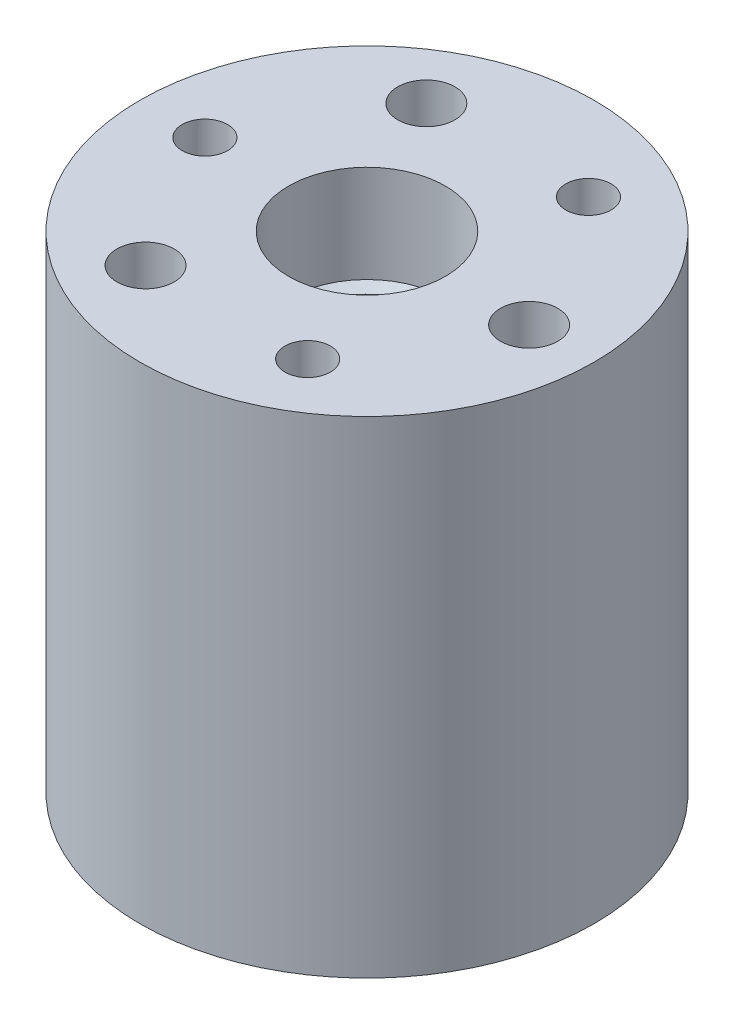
ISO-10303-21;
HEADER;
FILE_DESCRIPTION(('STEP AP214'),'2;1');
FILE_NAME('part.step','',(''),(''),'','','');
FILE_SCHEMA(('AUTOMOTIVE_DESIGN { 1 0 10303 214 1 1 1 1 }'));
ENDSEC;
DATA;
#1=APPLICATION_CONTEXT('core data for automotive mechanical design processes');
#2=APPLICATION_PROTOCOL_DEFINITION('international standard','automotive_design',2000,#1);
#3=PRODUCT_CONTEXT('',#1,'mechanical');
#4=PRODUCT('Part','Part','',(#3));
#5=PRODUCT_RELATED_PRODUCT_CATEGORY('part','',(#4));
#6=PRODUCT_DEFINITION_FORMATION('','',#4);
#7=PRODUCT_DEFINITION_CONTEXT('part definition',#1,'design');
#8=PRODUCT_DEFINITION('design','',#6,#7);
#9=PRODUCT_DEFINITION_SHAPE('','',#8);
#10=(LENGTH_UNIT() NAMED_UNIT(*) SI_UNIT(.MILLI.,.METRE.));
#11=(NAMED_UNIT(*) PLANE_ANGLE_UNIT() SI_UNIT($,.RADIAN.));
#12=(NAMED_UNIT(*) SI_UNIT($,.STERADIAN.) SOLID_ANGLE_UNIT());
#13=UNCERTAINTY_MEASURE_WITH_UNIT(LENGTH_MEASURE(1.E-05),#10,'distance_accuracy_value','');
#14=(GEOMETRIC_REPRESENTATION_CONTEXT(3) GLOBAL_UNCERTAINTY_ASSIGNED_CONTEXT((#13)) GLOBAL_UNIT_ASSIGNED_CONTEXT((#10,
#11,#12)) REPRESENTATION_CONTEXT('',''));
#15=CARTESIAN_POINT('',(0.,0.,0.));
#16=DIRECTION('',(0.,0.,1.));
#17=DIRECTION('',(1.,0.,0.));
#18=AXIS2_PLACEMENT_3D('',#15,#16,#17);
#19=CARTESIAN_POINT('',(0.,-43.,0.));
#20=DIRECTION('',(0.,-1.,0.));
#21=DIRECTION('',(0.,0.,-1.));
#22=AXIS2_PLACEMENT_3D('',#19,#20,#21);
#23=PLANE('',#22);
#24=CARTESIAN_POINT('',(0.,-43.,0.));
#25=DIRECTION('',(0.,1.,0.));
#26=DIRECTION('',(0.,0.,1.));
#27=AXIS2_PLACEMENT_3D('',#24,#25,#26);
#28=CIRCLE('',#27,4.2672);
#29=CARTESIAN_POINT('',(0.,-43.,4.2672));
#30=VERTEX_POINT('',#29);
#31=EDGE_CURVE('E195',#30,#30,#28,.T.);
#32=ORIENTED_EDGE('',*,*,#31,.F.);
#33=EDGE_LOOP('',(#32));
#34=FACE_BOUND('',#33,.T.);
#35=CARTESIAN_POINT('',(0.,-43.,0.));
#36=DIRECTION('',(0.,-1.,0.));
#37=DIRECTION('',(0.,0.,-1.));
#38=AXIS2_PLACEMENT_3D('',#35,#36,#37);
#39=CIRCLE('',#38,1.58749999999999);
#40=CARTESIAN_POINT('',(0.,-43.,-1.58749999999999));
#41=VERTEX_POINT('',#40);
#42=EDGE_CURVE('E82',#41,#41,#39,.F.);
#43=ORIENTED_EDGE('',*,*,#42,.T.);
#44=EDGE_LOOP('',(#43));
#45=FACE_BOUND('',#44,.T.);
#46=ADVANCED_FACE('F42',(#34,#45),#23,.T.);
#47=CARTESIAN_POINT('',(0.,0.,0.));
#48=DIRECTION('',(0.,1.,0.));
#49=DIRECTION('',(0.,0.,1.));
#50=AXIS2_PLACEMENT_3D('',#47,#48,#49);
#51=CYLINDRICAL_SURFACE('',#50,1.58749999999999);
#52=CARTESIAN_POINT('',(-1.37481532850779,-38.5,0.793749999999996));
#53=CARTESIAN_POINT('',(-1.37481893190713,-38.458639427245,0.793747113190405));
#54=CARTESIAN_POINT('',(-1.37671017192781,-38.417226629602,0.790495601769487));
#55=CARTESIAN_POINT('',(-1.38400128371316,-38.3356721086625,0.777655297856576));
#56=CARTESIAN_POINT('',(-1.38940852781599,-38.2955332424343,0.768053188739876));
#57=CARTESIAN_POINT('',(-1.40294793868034,-38.217860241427,0.743029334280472));
#58=CARTESIAN_POINT('',(-1.41106559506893,-38.1803134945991,0.727638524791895));
#59=CARTESIAN_POINT('',(-1.4290886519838,-38.1083445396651,0.691568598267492));
#60=CARTESIAN_POINT('',(-1.43899414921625,-38.0739225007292,0.670889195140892));
#61=CARTESIAN_POINT('',(-1.46047514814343,-38.0060448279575,0.622829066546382));
#62=CARTESIAN_POINT('',(-1.47212100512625,-37.9729030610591,0.595036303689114));
#63=CARTESIAN_POINT('',(-1.49520261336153,-37.9115070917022,0.53439520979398));
#64=CARTESIAN_POINT('',(-1.50663825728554,-37.8832553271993,0.501544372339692));
#65=CARTESIAN_POINT('',(-1.52893297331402,-37.8305773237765,0.429013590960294));
#66=CARTESIAN_POINT('',(-1.53970121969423,-37.8065373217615,0.389022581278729));
#67=CARTESIAN_POINT('',(-1.55853412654,-37.7656694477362,0.304924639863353));
#68=CARTESIAN_POINT('',(-1.56660049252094,-37.7488370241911,0.260820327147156));
#69=CARTESIAN_POINT('',(-1.57861366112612,-37.7241056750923,0.17307317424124));
#70=CARTESIAN_POINT('',(-1.58281274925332,-37.7156563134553,0.129620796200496));
#71=CARTESIAN_POINT('',(-1.58756019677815,-37.7061181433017,0.0417279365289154));
#72=CARTESIAN_POINT('',(-1.58811076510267,-37.7050248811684,-0.002711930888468));
#73=CARTESIAN_POINT('',(-1.58561866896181,-37.710017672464,-0.0871795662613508));
#74=CARTESIAN_POINT('',(-1.58288431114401,-37.71548767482,-0.127254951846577));
#75=CARTESIAN_POINT('',(-1.57459557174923,-37.7323491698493,-0.205830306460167));
#76=CARTESIAN_POINT('',(-1.56904097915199,-37.7437411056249,-0.244330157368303));
#77=CARTESIAN_POINT('',(-1.55552444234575,-37.7721967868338,-0.319333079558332));
#78=CARTESIAN_POINT('',(-1.54753025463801,-37.7893368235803,-0.355801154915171));
#79=CARTESIAN_POINT('',(-1.52985506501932,-37.8286965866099,-0.425431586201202));
#80=CARTESIAN_POINT('',(-1.52017345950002,-37.8509181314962,-0.458592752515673));
#81=CARTESIAN_POINT('',(-1.49895238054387,-37.9022231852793,-0.524012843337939));
#82=CARTESIAN_POINT('',(-1.4873237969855,-37.9317567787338,-0.55589017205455));
#83=CARTESIAN_POINT('',(-1.46410632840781,-37.9956430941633,-0.614445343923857));
#84=CARTESIAN_POINT('',(-1.45251748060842,-38.0299994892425,-0.64111918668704));
#85=CARTESIAN_POINT('',(-1.42989423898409,-38.1052270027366,-0.690169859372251));
#86=CARTESIAN_POINT('',(-1.41894178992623,-38.1463732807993,-0.712166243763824));
#87=CARTESIAN_POINT('',(-1.39998013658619,-38.2324567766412,-0.748759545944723));
#88=CARTESIAN_POINT('',(-1.39196786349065,-38.2773899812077,-0.76336418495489));
#89=CARTESIAN_POINT('',(-1.3806855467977,-38.3660265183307,-0.783574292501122));
#90=CARTESIAN_POINT('',(-1.37709001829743,-38.4095451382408,-0.789801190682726));
#91=CARTESIAN_POINT('',(-1.37412348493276,-38.4971435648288,-0.794954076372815));
#92=CARTESIAN_POINT('',(-1.3747494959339,-38.5412229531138,-0.793885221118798));
#93=CARTESIAN_POINT('',(-1.37981004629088,-38.6235502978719,-0.785047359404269));
#94=CARTESIAN_POINT('',(-1.38382047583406,-38.6619086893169,-0.778024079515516));
#95=CARTESIAN_POINT('',(-1.39457129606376,-38.7368294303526,-0.758583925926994));
#96=CARTESIAN_POINT('',(-1.40131257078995,-38.7733911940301,-0.746165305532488));
#97=CARTESIAN_POINT('',(-1.41713126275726,-38.845607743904,-0.715682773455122));
#98=CARTESIAN_POINT('',(-1.4263024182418,-38.8811420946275,-0.697384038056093));
#99=CARTESIAN_POINT('',(-1.44586419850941,-38.9488412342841,-0.65586535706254));
#100=CARTESIAN_POINT('',(-1.45625544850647,-38.9810042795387,-0.632642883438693));
#101=CARTESIAN_POINT('',(-1.47866098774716,-39.0452893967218,-0.578514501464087));
#102=CARTESIAN_POINT('',(-1.49071475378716,-39.0768952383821,-0.547009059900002));
#103=CARTESIAN_POINT('',(-1.51395299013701,-39.1345334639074,-0.47895231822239));
#104=CARTESIAN_POINT('',(-1.52513716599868,-39.1605639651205,-0.44239932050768));
#105=CARTESIAN_POINT('',(-1.54575955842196,-39.2068928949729,-0.363962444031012));
#106=CARTESIAN_POINT('',(-1.55514390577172,-39.2270219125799,-0.32196333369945));
#107=CARTESIAN_POINT('',(-1.57069912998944,-39.2597282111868,-0.234570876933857));
#108=CARTESIAN_POINT('',(-1.5768728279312,-39.272312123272,-0.189180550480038));
#109=CARTESIAN_POINT('',(-1.58486084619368,-39.2884862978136,-0.100790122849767));
#110=CARTESIAN_POINT('',(-1.58702317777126,-39.2927958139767,-0.0579528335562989));
#111=CARTESIAN_POINT('',(-1.58783440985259,-39.2944193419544,0.02788125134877));
#112=CARTESIAN_POINT('',(-1.58648454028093,-39.2917358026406,0.0708779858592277));
#113=CARTESIAN_POINT('',(-1.580625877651,-39.279925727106,0.152827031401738));
#114=CARTESIAN_POINT('',(-1.57633110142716,-39.2712354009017,0.191859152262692));
#115=CARTESIAN_POINT('',(-1.56521224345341,-39.2482466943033,0.267847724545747));
#116=CARTESIAN_POINT('',(-1.55838779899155,-39.2339475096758,0.304803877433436));
#117=CARTESIAN_POINT('',(-1.54246207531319,-39.1995104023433,0.377367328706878));
#118=CARTESIAN_POINT('',(-1.53327589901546,-39.1791489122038,0.412849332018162));
#119=CARTESIAN_POINT('',(-1.51358705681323,-39.1334458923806,0.480039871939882));
#120=CARTESIAN_POINT('',(-1.50308378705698,-39.1081020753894,0.511746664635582));
#121=CARTESIAN_POINT('',(-1.48057084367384,-39.0502297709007,0.573812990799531));
#122=CARTESIAN_POINT('',(-1.46851527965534,-39.017237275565,0.603724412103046));
#123=CARTESIAN_POINT('',(-1.44512566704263,-38.9465234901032,0.657751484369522));
#124=CARTESIAN_POINT('',(-1.4337922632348,-38.9087980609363,0.68186200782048));
#125=CARTESIAN_POINT('',(-1.41287186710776,-38.8281071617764,0.724242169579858));
#126=CARTESIAN_POINT('',(-1.40335138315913,-38.7850137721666,0.742303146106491));
#127=CARTESIAN_POINT('',(-1.38800011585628,-38.6957924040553,0.77063497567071));
#128=CARTESIAN_POINT('',(-1.38215700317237,-38.6496751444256,0.780931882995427));
#129=CARTESIAN_POINT('',(-1.3773886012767,-38.5858794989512,0.789278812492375));
#130=CARTESIAN_POINT('',(-1.37642702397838,-38.5687642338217,0.790952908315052));
#131=CARTESIAN_POINT('',(-1.37513961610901,-38.5344356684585,0.793189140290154));
#132=CARTESIAN_POINT('',(-1.37481382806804,-38.5172223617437,0.793751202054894));
#133=CARTESIAN_POINT('',(-1.37481532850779,-38.5,0.793749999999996));
#134=B_SPLINE_CURVE_WITH_KNOTS('',3,(#52,#53,#54,#55,#56,#57,#58,#59,#60,#61,#62,#63,#64,#65,
#66,#67,#68,#69,#70,#71,#72,#73,#74,#75,#76,#77,#78,#79,#80,#81,#82,#83,#84,#85,#86,#87,#88,#89,
#90,#91,#92,#93,#94,#95,#96,#97,#98,#99,#100,#101,#102,#103,#104,#105,#106,#107,#108,#109,#110,
#111,#112,#113,#114,#115,#116,#117,#118,#119,#120,#121,#122,#123,#124,#125,#126,#127,#128,#129,
#130,#131,#132,#133),.UNSPECIFIED.,.T.,.F.,(4,2,2,2,2,2,2,2,2,2,2,2,2,2,2,2,2,2,2,2,2,2,2,2,2,2,
2,2,2,2,2,2,2,2,2,2,2,2,2,2,4),(0.,0.124009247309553,0.248279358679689,0.371894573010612,
0.495516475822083,0.629334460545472,0.763218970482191,0.906128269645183,1.04894718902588,
1.18160391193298,1.31418031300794,1.43522777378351,1.55628429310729,1.67901568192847,
1.80179106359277,1.93617208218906,2.07065600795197,2.21368018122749,2.35655464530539,
2.48810693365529,2.6195662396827,2.7366450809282,2.85376185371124,2.97630291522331,
3.09890704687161,3.2369660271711,3.37507155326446,3.5168219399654,3.65844756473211,
3.78707864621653,3.91566468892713,4.03577762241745,4.15590778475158,4.28117595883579,
4.40650177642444,4.54430004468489,4.68221967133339,4.8244978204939,4.96629636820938,
5.01792982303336,5.06956673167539),.UNSPECIFIED.);
#135=CARTESIAN_POINT('',(-1.37481532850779,-38.5,0.793749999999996));
#136=VERTEX_POINT('',#135);
#137=EDGE_CURVE('E186',#136,#136,#134,.T.);
#138=ORIENTED_EDGE('',*,*,#137,.T.);
#139=EDGE_LOOP('',(#138));
#140=FACE_BOUND('',#139,.T.);
#141=CARTESIAN_POINT('',(0.,-36.,0.));
#142=DIRECTION('',(0.,1.,0.));
#143=DIRECTION('',(0.,0.,1.));
#144=AXIS2_PLACEMENT_3D('',#141,#142,#143);
#145=CIRCLE('',#144,1.58749999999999);
#146=CARTESIAN_POINT('',(0.,-36.,1.58749999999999));
#147=VERTEX_POINT('',#146);
#148=EDGE_CURVE('E133',#147,#147,#145,.F.);
#149=ORIENTED_EDGE('',*,*,#148,.F.);
#150=EDGE_LOOP('',(#149));
#151=FACE_BOUND('',#150,.T.);
#152=ORIENTED_EDGE('',*,*,#42,.F.);
#153=EDGE_LOOP('',(#152));
#154=FACE_BOUND('',#153,.T.);
#155=ADVANCED_FACE('F199',(#140,#151,#154),#51,.F.);
#156=CARTESIAN_POINT('',(0.,-45.,0.));
#157=DIRECTION('',(0.,1.,0.));
#158=DIRECTION('',(0.,0.,1.));
#159=AXIS2_PLACEMENT_3D('',#156,#157,#158);
#160=CYLINDRICAL_SURFACE('',#159,21.);
#161=CARTESIAN_POINT('',(-20.9026894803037,-38.5,2.0193));
#162=CARTESIAN_POINT('',(-20.9026907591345,-38.3868566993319,2.01929508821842));
#163=CARTESIAN_POINT('',(-20.9036180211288,-38.2736380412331,2.00975869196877));
#164=CARTESIAN_POINT('',(-20.9072264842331,-38.050338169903,1.97185930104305));
#165=CARTESIAN_POINT('',(-20.9099096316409,-37.9402605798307,1.94347541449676));
#166=CARTESIAN_POINT('',(-20.9167231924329,-37.7265089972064,1.86871380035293));
#167=CARTESIAN_POINT('',(-20.9208527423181,-37.6228312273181,1.82234680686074));
#168=CARTESIAN_POINT('',(-20.9300927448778,-37.4247528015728,1.71295542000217));
#169=CARTESIAN_POINT('',(-20.9352029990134,-37.330350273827,1.64993439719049));
#170=CARTESIAN_POINT('',(-20.9458479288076,-37.1531607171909,1.50879527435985));
#171=CARTESIAN_POINT('',(-20.9513838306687,-37.0704093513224,1.43063249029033));
#172=CARTESIAN_POINT('',(-20.9622451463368,-36.9191780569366,1.26152389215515));
#173=CARTESIAN_POINT('',(-20.967570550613,-36.8506987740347,1.17057750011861));
#174=CARTESIAN_POINT('',(-20.9774228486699,-36.7298332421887,0.978266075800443));
#175=CARTESIAN_POINT('',(-20.9819481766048,-36.6774784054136,0.876881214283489));
#176=CARTESIAN_POINT('',(-20.9896771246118,-36.5905488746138,0.666708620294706));
#177=CARTESIAN_POINT('',(-20.992880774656,-36.5559737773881,0.557921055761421));
#178=CARTESIAN_POINT('',(-20.9975968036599,-36.5056893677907,0.336390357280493));
#179=CARTESIAN_POINT('',(-20.9991144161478,-36.4899216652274,0.22366059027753));
#180=CARTESIAN_POINT('',(-21.0003051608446,-36.4775190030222,-0.00285480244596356));
#181=CARTESIAN_POINT('',(-20.9999783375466,-36.4808835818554,-0.116640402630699));
#182=CARTESIAN_POINT('',(-20.9975213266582,-36.5066024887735,-0.341641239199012));
#183=CARTESIAN_POINT('',(-20.9953971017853,-36.5288940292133,-0.452863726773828));
#184=CARTESIAN_POINT('',(-20.989590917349,-36.5917363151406,-0.669981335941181));
#185=CARTESIAN_POINT('',(-20.9859089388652,-36.6322872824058,-0.775876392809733));
#186=CARTESIAN_POINT('',(-20.9773910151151,-36.7305664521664,-0.979531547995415));
#187=CARTESIAN_POINT('',(-20.9725532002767,-36.7883225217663,-1.07727811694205));
#188=CARTESIAN_POINT('',(-20.962266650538,-36.9193521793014,-1.26171399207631));
#189=CARTESIAN_POINT('',(-20.9568178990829,-36.99262618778,-1.34840299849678));
#190=CARTESIAN_POINT('',(-20.945895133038,-37.152965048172,-1.50863056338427));
#191=CARTESIAN_POINT('',(-20.940421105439,-37.2400845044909,-1.58211448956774));
#192=CARTESIAN_POINT('',(-20.9300867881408,-37.4254516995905,-1.71342321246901));
#193=CARTESIAN_POINT('',(-20.9252264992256,-37.523699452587,-1.77124798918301));
#194=CARTESIAN_POINT('',(-20.9166694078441,-37.7285754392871,-1.86959626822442));
#195=CARTESIAN_POINT('',(-20.9129728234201,-37.8352052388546,-1.91011652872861));
#196=CARTESIAN_POINT('',(-20.9071661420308,-38.0537983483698,-1.97266300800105));
#197=CARTESIAN_POINT('',(-20.9050560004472,-38.1657615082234,-1.99468974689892));
#198=CARTESIAN_POINT('',(-20.902668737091,-38.391363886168,-2.01955392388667));
#199=CARTESIAN_POINT('',(-20.9023843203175,-38.5049946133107,-2.0224677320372));
#200=CARTESIAN_POINT('',(-20.9036614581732,-38.7311273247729,-2.00922377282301));
#201=CARTESIAN_POINT('',(-20.9052229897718,-38.843629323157,-1.99306624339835));
#202=CARTESIAN_POINT('',(-20.9100094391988,-39.0640892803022,-1.94220210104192));
#203=CARTESIAN_POINT('',(-20.913231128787,-39.1720556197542,-1.90753148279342));
#204=CARTESIAN_POINT('',(-20.9209722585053,-39.3806397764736,-1.82066204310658));
#205=CARTESIAN_POINT('',(-20.9254917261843,-39.481257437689,-1.76846284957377));
#206=CARTESIAN_POINT('',(-20.9353368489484,-39.672636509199,-1.64782621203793));
#207=CARTESIAN_POINT('',(-20.9406650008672,-39.7633658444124,-1.57933809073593));
#208=CARTESIAN_POINT('',(-20.9515189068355,-39.9320677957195,-1.42814049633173));
#209=CARTESIAN_POINT('',(-20.9570446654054,-40.0100401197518,-1.34543069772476));
#210=CARTESIAN_POINT('',(-20.9676931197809,-40.1512774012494,-1.16780658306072));
#211=CARTESIAN_POINT('',(-20.9728144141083,-40.2144925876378,-1.07285259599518));
#212=CARTESIAN_POINT('',(-20.9820565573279,-40.3240789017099,-0.873631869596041));
#213=CARTESIAN_POINT('',(-20.9861774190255,-40.3704502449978,-0.769365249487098));
#214=CARTESIAN_POINT('',(-20.992948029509,-40.4449479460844,-0.554653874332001));
#215=CARTESIAN_POINT('',(-20.9956002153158,-40.4731045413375,-0.444219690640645));
#216=CARTESIAN_POINT('',(-20.9991446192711,-40.5104722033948,-0.220164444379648));
#217=CARTESIAN_POINT('',(-21.0000368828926,-40.5196837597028,-0.106543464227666));
#218=CARTESIAN_POINT('',(-20.9999609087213,-40.5188932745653,0.120170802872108));
#219=CARTESIAN_POINT('',(-20.9990001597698,-40.5089685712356,0.233264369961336));
#220=CARTESIAN_POINT('',(-20.9953408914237,-40.4703492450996,0.456169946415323));
#221=CARTESIAN_POINT('',(-20.9926423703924,-40.4416546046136,0.565981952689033));
#222=CARTESIAN_POINT('',(-20.9858100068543,-40.3663309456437,0.779208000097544));
#223=CARTESIAN_POINT('',(-20.9816763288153,-40.3197039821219,0.882622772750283));
#224=CARTESIAN_POINT('',(-20.9724348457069,-40.2098476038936,1.08017002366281));
#225=CARTESIAN_POINT('',(-20.9673270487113,-40.1466183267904,1.17430257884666));
#226=CARTESIAN_POINT('',(-20.956685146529,-40.0050619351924,1.35100961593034));
#227=CARTESIAN_POINT('',(-20.9511494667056,-39.9266772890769,1.4335379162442));
#228=CARTESIAN_POINT('',(-20.9402890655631,-39.7571468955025,1.58430530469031));
#229=CARTESIAN_POINT('',(-20.9349643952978,-39.6659980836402,1.65254095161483));
#230=CARTESIAN_POINT('',(-20.9251153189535,-39.4732923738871,1.7729117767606));
#231=CARTESIAN_POINT('',(-20.9205928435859,-39.3717112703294,1.82500833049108));
#232=CARTESIAN_POINT('',(-20.9128833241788,-39.1612656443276,1.91133637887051));
#233=CARTESIAN_POINT('',(-20.9096947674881,-39.0524095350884,1.94558812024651));
#234=CARTESIAN_POINT('',(-20.9058221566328,-38.8691087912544,1.98666784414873));
#235=CARTESIAN_POINT('',(-20.9046529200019,-38.7958378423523,1.99888829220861));
#236=CARTESIAN_POINT('',(-20.9030861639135,-38.6483887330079,2.01520596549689));
#237=CARTESIAN_POINT('',(-20.9026886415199,-38.5742105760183,2.01930322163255));
#238=CARTESIAN_POINT('',(-20.9026894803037,-38.5,2.0193));
#239=B_SPLINE_CURVE_WITH_KNOTS('',3,(#161,#162,#163,#164,#165,#166,#167,#168,#169,#170,#171,
#172,#173,#174,#175,#176,#177,#178,#179,#180,#181,#182,#183,#184,#185,#186,#187,#188,#189,#190,
#191,#192,#193,#194,#195,#196,#197,#198,#199,#200,#201,#202,#203,#204,#205,#206,#207,#208,#209,
#210,#211,#212,#213,#214,#215,#216,#217,#218,#219,#220,#221,#222,#223,#224,#225,#226,#227,#228,
#229,#230,#231,#232,#233,#234,#235,#236,#237,#238),.UNSPECIFIED.,.T.,.F.,(4,2,2,2,2,2,2,2,2,2,2,
2,2,2,2,2,2,2,2,2,2,2,2,2,2,2,2,2,2,2,2,2,2,2,2,2,2,2,4),(0.,0.339158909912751,
0.678694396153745,1.01802752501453,1.35729202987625,1.69757340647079,2.03787017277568,
2.37882574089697,2.71977357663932,3.05966011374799,3.39953845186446,3.73829367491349,
4.07705301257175,4.41636404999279,4.75568428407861,5.09637756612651,5.43707128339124,
5.77782879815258,6.11857672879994,6.45796228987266,6.79734361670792,7.13606748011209,
7.47479853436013,7.81459754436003,8.15440433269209,8.49534113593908,8.83627357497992,
9.17663858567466,9.51699480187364,9.85597837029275,10.1949622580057,10.5339073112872,
10.8728495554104,11.213104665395,11.5534416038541,11.8945868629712,12.2353442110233,
12.4577990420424,12.6802530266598),.UNSPECIFIED.);
#240=CARTESIAN_POINT('',(-20.9026894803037,-38.5,2.0193));
#241=VERTEX_POINT('',#240);
#242=EDGE_CURVE('E138',#241,#241,#239,.T.);
#243=ORIENTED_EDGE('',*,*,#242,.F.);
#244=EDGE_LOOP('',(#243));
#245=FACE_BOUND('',#244,.T.);
#246=CARTESIAN_POINT('',(0.,-45.,0.));
#247=DIRECTION('',(0.,1.,0.));
#248=DIRECTION('',(0.,0.,1.));
#249=AXIS2_PLACEMENT_3D('',#246,#247,#248);
#250=CIRCLE('',#249,21.);
#251=CARTESIAN_POINT('',(0.,-45.,21.));
#252=VERTEX_POINT('',#251);
#253=EDGE_CURVE('E134',#252,#252,#250,.T.);
#254=ORIENTED_EDGE('',*,*,#253,.T.);
#255=EDGE_LOOP('',(#254));
#256=FACE_BOUND('',#255,.T.);
#257=CARTESIAN_POINT('',(0.,0.,0.));
#258=DIRECTION('',(0.,1.,0.));
#259=DIRECTION('',(0.,0.,1.));
#260=AXIS2_PLACEMENT_3D('',#257,#258,#259);
#261=CIRCLE('',#260,21.);
#262=CARTESIAN_POINT('',(0.,0.,21.));
#263=VERTEX_POINT('',#262);
#264=EDGE_CURVE('E139',#263,#263,#261,.T.);
#265=ORIENTED_EDGE('',*,*,#264,.F.);
#266=EDGE_LOOP('',(#265));
#267=FACE_BOUND('',#266,.T.);
#268=ADVANCED_FACE('F162',(#245,#256,#267),#160,.T.);
#269=CARTESIAN_POINT('',(0.,-45.,0.));
#270=DIRECTION('',(0.,1.,0.));
#271=DIRECTION('',(0.,0.,1.));
#272=AXIS2_PLACEMENT_3D('',#269,#270,#271);
#273=PLANE('',#272);
#274=CARTESIAN_POINT('',(0.,-45.,0.));
#275=DIRECTION('',(0.,1.,0.));
#276=DIRECTION('',(0.,0.,1.));
#277=AXIS2_PLACEMENT_3D('',#274,#275,#276);
#278=CIRCLE('',#277,8.50000000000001);
#279=CARTESIAN_POINT('',(0.,-45.,8.50000000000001));
#280=VERTEX_POINT('',#279);
#281=EDGE_CURVE('E11',#280,#280,#278,.T.);
#282=ORIENTED_EDGE('',*,*,#281,.T.);
#283=EDGE_LOOP('',(#282));
#284=FACE_BOUND('',#283,.T.);
#285=CARTESIAN_POINT('',(-7.49999999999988,-45.,-12.9903810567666));
#286=DIRECTION('',(0.,1.,0.));
#287=DIRECTION('',(0.,0.,1.));
#288=AXIS2_PLACEMENT_3D('',#285,#286,#287);
#289=CIRCLE('',#288,2.64999999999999);
#290=CARTESIAN_POINT('',(-7.49999999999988,-45.,-10.3403810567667));
#291=VERTEX_POINT('',#290);
#292=EDGE_CURVE('E101',#291,#291,#289,.T.);
#293=ORIENTED_EDGE('',*,*,#292,.T.);
#294=EDGE_LOOP('',(#293));
#295=FACE_BOUND('',#294,.T.);
#296=CARTESIAN_POINT('',(-7.50000000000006,-45.,12.9903810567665));
#297=DIRECTION('',(0.,1.,0.));
#298=DIRECTION('',(0.,0.,1.));
#299=AXIS2_PLACEMENT_3D('',#296,#297,#298);
#300=CIRCLE('',#299,2.64999999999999);
#301=CARTESIAN_POINT('',(-7.50000000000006,-45.,15.6403810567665));
#302=VERTEX_POINT('',#301);
#303=EDGE_CURVE('E108',#302,#302,#300,.T.);
#304=ORIENTED_EDGE('',*,*,#303,.T.);
#305=EDGE_LOOP('',(#304));
#306=FACE_BOUND('',#305,.T.);
#307=CARTESIAN_POINT('',(15.,-45.,0.));
#308=DIRECTION('',(0.,1.,0.));
#309=DIRECTION('',(0.,0.,1.));
#310=AXIS2_PLACEMENT_3D('',#307,#308,#309);
#311=CIRCLE('',#310,2.64999999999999);
#312=CARTESIAN_POINT('',(15.,-45.,2.64999999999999));
#313=VERTEX_POINT('',#312);
#314=EDGE_CURVE('E116',#313,#313,#311,.T.);
#315=ORIENTED_EDGE('',*,*,#314,.T.);
#316=EDGE_LOOP('',(#315));
#317=FACE_BOUND('',#316,.T.);
#318=ORIENTED_EDGE('',*,*,#253,.F.);
#319=EDGE_LOOP('',(#318));
#320=FACE_BOUND('',#319,.T.);
#321=ADVANCED_FACE('F207',(#284,#295,#306,#317,#320),#273,.F.);
#322=CARTESIAN_POINT('',(0.,0.,0.));
#323=DIRECTION('',(0.,1.,0.));
#324=DIRECTION('',(0.,0.,1.));
#325=AXIS2_PLACEMENT_3D('',#322,#323,#324);
#326=PLANE('',#325);
#327=CARTESIAN_POINT('',(7.49999999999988,0.,12.9903810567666));
#328=DIRECTION('',(0.,1.,0.));
#329=DIRECTION('',(0.,0.,1.));
#330=AXIS2_PLACEMENT_3D('',#327,#328,#329);
#331=CIRCLE('',#330,2.09999999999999);
#332=CARTESIAN_POINT('',(7.49999999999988,0.,15.0903810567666));
#333=VERTEX_POINT('',#332);
#334=EDGE_CURVE('E73',#333,#333,#331,.T.);
#335=ORIENTED_EDGE('',*,*,#334,.F.);
#336=EDGE_LOOP('',(#335));
#337=FACE_BOUND('',#336,.T.);
#338=CARTESIAN_POINT('',(7.50000000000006,0.,-12.9903810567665));
#339=DIRECTION('',(0.,1.,0.));
#340=DIRECTION('',(0.,0.,1.));
#341=AXIS2_PLACEMENT_3D('',#338,#339,#340);
#342=CIRCLE('',#341,2.09999999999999);
#343=CARTESIAN_POINT('',(7.50000000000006,0.,-10.8903810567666));
#344=VERTEX_POINT('',#343);
#345=EDGE_CURVE('E72',#344,#344,#342,.T.);
#346=ORIENTED_EDGE('',*,*,#345,.F.);
#347=EDGE_LOOP('',(#346));
#348=FACE_BOUND('',#347,.T.);
#349=CARTESIAN_POINT('',(-15.,0.,0.));
#350=DIRECTION('',(0.,1.,0.));
#351=DIRECTION('',(0.,0.,1.));
#352=AXIS2_PLACEMENT_3D('',#349,#350,#351);
#353=CIRCLE('',#352,2.09999999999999);
#354=CARTESIAN_POINT('',(-15.,0.,2.09999999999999));
#355=VERTEX_POINT('',#354);
#356=EDGE_CURVE('E89',#355,#355,#353,.T.);
#357=ORIENTED_EDGE('',*,*,#356,.F.);
#358=EDGE_LOOP('',(#357));
#359=FACE_BOUND('',#358,.T.);
#360=CARTESIAN_POINT('',(-7.49999999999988,0.,-12.9903810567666));
#361=DIRECTION('',(0.,1.,0.));
#362=DIRECTION('',(0.,0.,1.));
#363=AXIS2_PLACEMENT_3D('',#360,#361,#362);
#364=CIRCLE('',#363,2.65);
#365=CARTESIAN_POINT('',(-7.49999999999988,0.,-10.3403810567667));
#366=VERTEX_POINT('',#365);
#367=EDGE_CURVE('E97',#366,#366,#364,.T.);
#368=ORIENTED_EDGE('',*,*,#367,.F.);
#369=EDGE_LOOP('',(#368));
#370=FACE_BOUND('',#369,.T.);
#371=CARTESIAN_POINT('',(-7.50000000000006,0.,12.9903810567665));
#372=DIRECTION('',(0.,1.,0.));
#373=DIRECTION('',(0.,0.,1.));
#374=AXIS2_PLACEMENT_3D('',#371,#372,#373);
#375=CIRCLE('',#374,2.65);
#376=CARTESIAN_POINT('',(-7.50000000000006,0.,15.6403810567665));
#377=VERTEX_POINT('',#376);
#378=EDGE_CURVE('E104',#377,#377,#375,.T.);
#379=ORIENTED_EDGE('',*,*,#378,.F.);
#380=EDGE_LOOP('',(#379));
#381=FACE_BOUND('',#380,.T.);
#382=CARTESIAN_POINT('',(15.,0.,0.));
#383=DIRECTION('',(0.,1.,0.));
#384=DIRECTION('',(0.,0.,1.));
#385=AXIS2_PLACEMENT_3D('',#382,#383,#384);
#386=CIRCLE('',#385,2.65);
#387=CARTESIAN_POINT('',(15.,0.,2.65));
#388=VERTEX_POINT('',#387);
#389=EDGE_CURVE('E112',#388,#388,#386,.T.);
#390=ORIENTED_EDGE('',*,*,#389,.F.);
#391=EDGE_LOOP('',(#390));
#392=FACE_BOUND('',#391,.T.);
#393=CARTESIAN_POINT('',(0.,0.,0.));
#394=DIRECTION('',(0.,1.,0.));
#395=DIRECTION('',(0.,0.,1.));
#396=AXIS2_PLACEMENT_3D('',#393,#394,#395);
#397=CIRCLE('',#396,7.24999999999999);
#398=CARTESIAN_POINT('',(0.,0.,7.24999999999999));
#399=VERTEX_POINT('',#398);
#400=EDGE_CURVE('E120',#399,#399,#397,.T.);
#401=ORIENTED_EDGE('',*,*,#400,.F.);
#402=EDGE_LOOP('',(#401));
#403=FACE_BOUND('',#402,.T.);
#404=ORIENTED_EDGE('',*,*,#264,.T.);
#405=EDGE_LOOP('',(#404));
#406=FACE_BOUND('',#405,.T.);
#407=ADVANCED_FACE('F209',(#337,#348,#359,#370,#381,#392,#403,#406),#326,.T.);
#408=CARTESIAN_POINT('',(0.,-36.,0.));
#409=DIRECTION('',(0.,1.,0.));
#410=DIRECTION('',(0.,0.,1.));
#411=AXIS2_PLACEMENT_3D('',#408,#409,#410);
#412=PLANE('',#411);
#413=CARTESIAN_POINT('',(0.,-36.,0.));
#414=DIRECTION('',(0.,1.,0.));
#415=DIRECTION('',(0.,0.,1.));
#416=AXIS2_PLACEMENT_3D('',#413,#414,#415);
#417=CIRCLE('',#416,6.35);
#418=CARTESIAN_POINT('',(0.,-36.,6.35));
#419=VERTEX_POINT('',#418);
#420=EDGE_CURVE('E129',#419,#419,#417,.T.);
#421=ORIENTED_EDGE('',*,*,#420,.T.);
#422=EDGE_LOOP('',(#421));
#423=FACE_BOUND('',#422,.T.);
#424=ORIENTED_EDGE('',*,*,#148,.T.);
#425=EDGE_LOOP('',(#424));
#426=FACE_BOUND('',#425,.T.);
#427=ADVANCED_FACE('F212',(#423,#426),#412,.T.);
#428=CARTESIAN_POINT('',(0.,-36.,0.));
#429=DIRECTION('',(0.,1.,0.));
#430=DIRECTION('',(0.,0.,1.));
#431=AXIS2_PLACEMENT_3D('',#428,#429,#430);
#432=CYLINDRICAL_SURFACE('',#431,6.35);
#433=CARTESIAN_POINT('',(0.,-9.5407745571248,0.));
#434=DIRECTION('',(0.,1.,0.));
#435=DIRECTION('',(0.,0.,1.));
#436=AXIS2_PLACEMENT_3D('',#433,#434,#435);
#437=CIRCLE('',#436,6.35);
#438=CARTESIAN_POINT('',(0.,-9.5407745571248,6.35));
#439=VERTEX_POINT('',#438);
#440=EDGE_CURVE('E128',#439,#439,#437,.T.);
#441=ORIENTED_EDGE('',*,*,#440,.T.);
#442=EDGE_LOOP('',(#441));
#443=FACE_BOUND('',#442,.T.);
#444=ORIENTED_EDGE('',*,*,#420,.F.);
#445=EDGE_LOOP('',(#444));
#446=FACE_BOUND('',#445,.T.);
#447=ADVANCED_FACE('F205',(#443,#446),#432,.F.);
#448=CARTESIAN_POINT('',(0.,-9.,0.));
#449=DIRECTION('',(0.,1.,0.));
#450=DIRECTION('',(0.,0.,1.));
#451=AXIS2_PLACEMENT_3D('',#448,#449,#450);
#452=CONICAL_SURFACE('',#451,7.25,1.02974425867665);
#453=CARTESIAN_POINT('',(0.,-9.,0.));
#454=DIRECTION('',(0.,1.,0.));
#455=DIRECTION('',(0.,0.,1.));
#456=AXIS2_PLACEMENT_3D('',#453,#454,#455);
#457=CIRCLE('',#456,7.25);
#458=CARTESIAN_POINT('',(0.,-9.,7.25));
#459=VERTEX_POINT('',#458);
#460=EDGE_CURVE('E124',#459,#459,#457,.T.);
#461=ORIENTED_EDGE('',*,*,#460,.T.);
#462=EDGE_LOOP('',(#461));
#463=FACE_BOUND('',#462,.T.);
#464=ORIENTED_EDGE('',*,*,#440,.F.);
#465=EDGE_LOOP('',(#464));
#466=FACE_BOUND('',#465,.T.);
#467=ADVANCED_FACE('F493',(#463,#466),#452,.F.);
#468=CARTESIAN_POINT('',(0.,0.,0.));
#469=DIRECTION('',(0.,1.,0.));
#470=DIRECTION('',(0.,0.,1.));
#471=AXIS2_PLACEMENT_3D('',#468,#469,#470);
#472=CYLINDRICAL_SURFACE('',#471,7.24999999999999);
#473=ORIENTED_EDGE('',*,*,#460,.F.);
#474=EDGE_LOOP('',(#473));
#475=FACE_BOUND('',#474,.T.);
#476=ORIENTED_EDGE('',*,*,#400,.T.);
#477=EDGE_LOOP('',(#476));
#478=FACE_BOUND('',#477,.T.);
#479=ADVANCED_FACE('F483',(#475,#478),#472,.F.);
#480=CARTESIAN_POINT('',(15.,0.,0.));
#481=DIRECTION('',(0.,1.,0.));
#482=DIRECTION('',(0.,0.,1.));
#483=AXIS2_PLACEMENT_3D('',#480,#481,#482);
#484=CYLINDRICAL_SURFACE('',#483,2.64999999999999);
#485=ORIENTED_EDGE('',*,*,#314,.F.);
#486=EDGE_LOOP('',(#485));
#487=FACE_BOUND('',#486,.T.);
#488=ORIENTED_EDGE('',*,*,#389,.T.);
#489=EDGE_LOOP('',(#488));
#490=FACE_BOUND('',#489,.T.);
#491=ADVANCED_FACE('F473',(#487,#490),#484,.F.);
#492=CARTESIAN_POINT('',(-7.50000000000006,0.,12.9903810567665));
#493=DIRECTION('',(0.,1.,0.));
#494=DIRECTION('',(0.,0.,1.));
#495=AXIS2_PLACEMENT_3D('',#492,#493,#494);
#496=CYLINDRICAL_SURFACE('',#495,2.64999999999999);
#497=ORIENTED_EDGE('',*,*,#303,.F.);
#498=EDGE_LOOP('',(#497));
#499=FACE_BOUND('',#498,.T.);
#500=ORIENTED_EDGE('',*,*,#378,.T.);
#501=EDGE_LOOP('',(#500));
#502=FACE_BOUND('',#501,.T.);
#503=ADVANCED_FACE('F463',(#499,#502),#496,.F.);
#504=CARTESIAN_POINT('',(-7.49999999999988,0.,-12.9903810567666));
#505=DIRECTION('',(0.,1.,0.));
#506=DIRECTION('',(0.,0.,1.));
#507=AXIS2_PLACEMENT_3D('',#504,#505,#506);
#508=CYLINDRICAL_SURFACE('',#507,2.64999999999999);
#509=ORIENTED_EDGE('',*,*,#292,.F.);
#510=EDGE_LOOP('',(#509));
#511=FACE_BOUND('',#510,.T.);
#512=ORIENTED_EDGE('',*,*,#367,.T.);
#513=EDGE_LOOP('',(#512));
#514=FACE_BOUND('',#513,.T.);
#515=ADVANCED_FACE('F454',(#511,#514),#508,.F.);
#516=CARTESIAN_POINT('',(-15.,-18.,0.));
#517=DIRECTION('',(0.,1.,0.));
#518=DIRECTION('',(0.,0.,1.));
#519=AXIS2_PLACEMENT_3D('',#516,#517,#518);
#520=CONICAL_SURFACE('',#519,2.1,1.02974425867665);
#521=CARTESIAN_POINT('',(-15.,-19.2618072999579,0.));
#522=VERTEX_POINT('',#521);
#523=VERTEX_LOOP('',#522);
#524=FACE_BOUND('',#523,.T.);
#525=CARTESIAN_POINT('',(-15.,-18.,0.));
#526=DIRECTION('',(0.,1.,0.));
#527=DIRECTION('',(0.,0.,1.));
#528=AXIS2_PLACEMENT_3D('',#525,#526,#527);
#529=CIRCLE('',#528,2.1);
#530=CARTESIAN_POINT('',(-15.,-18.,2.1));
#531=VERTEX_POINT('',#530);
#532=EDGE_CURVE('E93',#531,#531,#529,.T.);
#533=ORIENTED_EDGE('',*,*,#532,.T.);
#534=EDGE_LOOP('',(#533));
#535=FACE_BOUND('',#534,.T.);
#536=ADVANCED_FACE('F442',(#524,#535),#520,.F.);
#537=CARTESIAN_POINT('',(-15.,0.,0.));
#538=DIRECTION('',(0.,1.,0.));
#539=DIRECTION('',(0.,0.,1.));
#540=AXIS2_PLACEMENT_3D('',#537,#538,#539);
#541=CYLINDRICAL_SURFACE('',#540,2.09999999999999);
#542=ORIENTED_EDGE('',*,*,#532,.F.);
#543=EDGE_LOOP('',(#542));
#544=FACE_BOUND('',#543,.T.);
#545=ORIENTED_EDGE('',*,*,#356,.T.);
#546=EDGE_LOOP('',(#545));
#547=FACE_BOUND('',#546,.T.);
#548=ADVANCED_FACE('F427',(#544,#547),#541,.F.);
#549=CARTESIAN_POINT('',(7.50000000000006,-18.,-12.9903810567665));
#550=DIRECTION('',(0.,1.,0.));
#551=DIRECTION('',(0.,0.,1.));
#552=AXIS2_PLACEMENT_3D('',#549,#550,#551);
#553=CONICAL_SURFACE('',#552,2.1,1.02974425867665);
#554=CARTESIAN_POINT('',(7.50000000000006,-19.2618072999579,-12.9903810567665));
#555=VERTEX_POINT('',#554);
#556=VERTEX_LOOP('',#555);
#557=FACE_BOUND('',#556,.T.);
#558=CARTESIAN_POINT('',(7.50000000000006,-18.,-12.9903810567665));
#559=DIRECTION('',(0.,1.,0.));
#560=DIRECTION('',(0.,0.,1.));
#561=AXIS2_PLACEMENT_3D('',#558,#559,#560);
#562=CIRCLE('',#561,2.1);
#563=CARTESIAN_POINT('',(7.50000000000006,-18.,-10.8903810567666));
#564=VERTEX_POINT('',#563);
#565=EDGE_CURVE('E78',#564,#564,#562,.T.);
#566=ORIENTED_EDGE('',*,*,#565,.T.);
#567=EDGE_LOOP('',(#566));
#568=FACE_BOUND('',#567,.T.);
#569=ADVANCED_FACE('F416',(#557,#568),#553,.F.);
#570=CARTESIAN_POINT('',(7.50000000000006,0.,-12.9903810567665));
#571=DIRECTION('',(0.,1.,0.));
#572=DIRECTION('',(0.,0.,1.));
#573=AXIS2_PLACEMENT_3D('',#570,#571,#572);
#574=CYLINDRICAL_SURFACE('',#573,2.09999999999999);
#575=ORIENTED_EDGE('',*,*,#565,.F.);
#576=EDGE_LOOP('',(#575));
#577=FACE_BOUND('',#576,.T.);
#578=ORIENTED_EDGE('',*,*,#345,.T.);
#579=EDGE_LOOP('',(#578));
#580=FACE_BOUND('',#579,.T.);
#581=ADVANCED_FACE('F65',(#577,#580),#574,.F.);
#582=CARTESIAN_POINT('',(7.49999999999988,-18.,12.9903810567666));
#583=DIRECTION('',(0.,1.,0.));
#584=DIRECTION('',(0.,0.,1.));
#585=AXIS2_PLACEMENT_3D('',#582,#583,#584);
#586=CONICAL_SURFACE('',#585,2.1,1.02974425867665);
#587=CARTESIAN_POINT('',(7.49999999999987,-19.2618072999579,12.9903810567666));
#588=VERTEX_POINT('',#587);
#589=VERTEX_LOOP('',#588);
#590=FACE_BOUND('',#589,.T.);
#591=CARTESIAN_POINT('',(7.49999999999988,-18.,12.9903810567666));
#592=DIRECTION('',(0.,1.,0.));
#593=DIRECTION('',(0.,0.,1.));
#594=AXIS2_PLACEMENT_3D('',#591,#592,#593);
#595=CIRCLE('',#594,2.1);
#596=CARTESIAN_POINT('',(7.49999999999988,-18.,15.0903810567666));
#597=VERTEX_POINT('',#596);
#598=EDGE_CURVE('E69',#597,#597,#595,.T.);
#599=ORIENTED_EDGE('',*,*,#598,.T.);
#600=EDGE_LOOP('',(#599));
#601=FACE_BOUND('',#600,.T.);
#602=ADVANCED_FACE('F61',(#590,#601),#586,.F.);
#603=CARTESIAN_POINT('',(7.49999999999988,0.,12.9903810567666));
#604=DIRECTION('',(0.,1.,0.));
#605=DIRECTION('',(0.,0.,1.));
#606=AXIS2_PLACEMENT_3D('',#603,#604,#605);
#607=CYLINDRICAL_SURFACE('',#606,2.09999999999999);
#608=ORIENTED_EDGE('',*,*,#598,.F.);
#609=EDGE_LOOP('',(#608));
#610=FACE_BOUND('',#609,.T.);
#611=ORIENTED_EDGE('',*,*,#334,.T.);
#612=EDGE_LOOP('',(#611));
#613=FACE_BOUND('',#612,.T.);
#614=ADVANCED_FACE('F64',(#610,#613),#607,.F.);
#615=CARTESIAN_POINT('',(0.,-43.,0.));
#616=DIRECTION('',(0.,1.,0.));
#617=DIRECTION('',(0.,0.,1.));
#618=AXIS2_PLACEMENT_3D('',#615,#616,#617);
#619=CIRCLE('',#618,6.4008);
#620=CARTESIAN_POINT('',(0.,-43.,6.4008));
#621=VERTEX_POINT('',#620);
#622=EDGE_CURVE('E243',#621,#621,#619,.T.);
#623=ORIENTED_EDGE('',*,*,#622,.T.);
#624=EDGE_LOOP('',(#623));
#625=FACE_BOUND('',#624,.T.);
#626=CARTESIAN_POINT('',(0.,-43.,0.));
#627=DIRECTION('',(0.,-1.,0.));
#628=DIRECTION('',(0.,0.,-1.));
#629=AXIS2_PLACEMENT_3D('',#626,#627,#628);
#630=CIRCLE('',#629,8.);
#631=CARTESIAN_POINT('',(0.,-43.,-8.));
#632=VERTEX_POINT('',#631);
#633=EDGE_CURVE('E152',#632,#632,#630,.T.);
#634=ORIENTED_EDGE('',*,*,#633,.T.);
#635=EDGE_LOOP('',(#634));
#636=FACE_BOUND('',#635,.T.);
#637=ADVANCED_FACE('F223',(#625,#636),#23,.T.);
#638=CARTESIAN_POINT('',(0.,-43.,0.));
#639=DIRECTION('',(0.,-1.,0.));
#640=DIRECTION('',(0.,0.,-1.));
#641=AXIS2_PLACEMENT_3D('',#638,#639,#640);
#642=CYLINDRICAL_SURFACE('',#641,8.);
#643=CARTESIAN_POINT('',(0.,-44.5,0.));
#644=DIRECTION('',(0.,1.,0.));
#645=DIRECTION('',(0.,0.,1.));
#646=AXIS2_PLACEMENT_3D('',#643,#644,#645);
#647=CIRCLE('',#646,8.);
#648=CARTESIAN_POINT('',(0.,-44.5,8.));
#649=VERTEX_POINT('',#648);
#650=EDGE_CURVE('E51',#649,#649,#647,.F.);
#651=ORIENTED_EDGE('',*,*,#650,.T.);
#652=EDGE_LOOP('',(#651));
#653=FACE_BOUND('',#652,.T.);
#654=ORIENTED_EDGE('',*,*,#633,.F.);
#655=EDGE_LOOP('',(#654));
#656=FACE_BOUND('',#655,.T.);
#657=ADVANCED_FACE('F231',(#653,#656),#642,.F.);
#658=CARTESIAN_POINT('',(0.,15.1319922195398,0.));
#659=DIRECTION('',(0.,1.,0.));
#660=DIRECTION('',(0.,0.,1.));
#661=AXIS2_PLACEMENT_3D('',#658,#659,#660);
#662=CYLINDRICAL_SURFACE('',#661,4.2672);
#663=CARTESIAN_POINT('',(0.,-41.6792,0.));
#664=DIRECTION('',(0.,1.,0.));
#665=DIRECTION('',(0.,0.,1.));
#666=AXIS2_PLACEMENT_3D('',#663,#664,#665);
#667=CIRCLE('',#666,4.2672);
#668=CARTESIAN_POINT('',(0.,-41.6792,4.2672));
#669=VERTEX_POINT('',#668);
#670=EDGE_CURVE('E248',#669,#669,#667,.T.);
#671=ORIENTED_EDGE('',*,*,#670,.F.);
#672=EDGE_LOOP('',(#671));
#673=FACE_BOUND('',#672,.T.);
#674=ORIENTED_EDGE('',*,*,#31,.T.);
#675=EDGE_LOOP('',(#674));
#676=FACE_BOUND('',#675,.T.);
#677=ADVANCED_FACE('F237',(#673,#676),#662,.T.);
#678=CARTESIAN_POINT('',(0.,-41.6792,4.2672));
#679=DIRECTION('',(0.,1.,0.));
#680=DIRECTION('',(0.,0.,1.));
#681=AXIS2_PLACEMENT_3D('',#678,#679,#680);
#682=PLANE('',#681);
#683=CARTESIAN_POINT('',(0.,-41.6792,0.));
#684=DIRECTION('',(0.,1.,0.));
#685=DIRECTION('',(0.,0.,1.));
#686=AXIS2_PLACEMENT_3D('',#683,#684,#685);
#687=CIRCLE('',#686,6.4008);
#688=CARTESIAN_POINT('',(0.,-41.6792,6.4008));
#689=VERTEX_POINT('',#688);
#690=EDGE_CURVE('E251',#689,#689,#687,.T.);
#691=ORIENTED_EDGE('',*,*,#690,.F.);
#692=EDGE_LOOP('',(#691));
#693=FACE_BOUND('',#692,.T.);
#694=ORIENTED_EDGE('',*,*,#670,.T.);
#695=EDGE_LOOP('',(#694));
#696=FACE_BOUND('',#695,.T.);
#697=ADVANCED_FACE('F262',(#693,#696),#682,.F.);
#698=CARTESIAN_POINT('',(0.,15.1319922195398,0.));
#699=DIRECTION('',(0.,1.,0.));
#700=DIRECTION('',(0.,0.,1.));
#701=AXIS2_PLACEMENT_3D('',#698,#699,#700);
#702=CYLINDRICAL_SURFACE('',#701,6.4008);
#703=ORIENTED_EDGE('',*,*,#622,.F.);
#704=EDGE_LOOP('',(#703));
#705=FACE_BOUND('',#704,.T.);
#706=ORIENTED_EDGE('',*,*,#690,.T.);
#707=EDGE_LOOP('',(#706));
#708=FACE_BOUND('',#707,.T.);
#709=ADVANCED_FACE('F182',(#705,#708),#702,.F.);
#710=CARTESIAN_POINT('',(-21.,-38.5,0.));
#711=DIRECTION('',(-1.,0.,0.));
#712=DIRECTION('',(0.,0.,1.));
#713=AXIS2_PLACEMENT_3D('',#710,#711,#712);
#714=CYLINDRICAL_SURFACE('',#713,0.793749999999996);
#715=CARTESIAN_POINT('',(-10.586,-38.5,0.));
#716=DIRECTION('',(1.,0.,0.));
#717=DIRECTION('',(0.,0.,-1.));
#718=AXIS2_PLACEMENT_3D('',#715,#716,#717);
#719=CIRCLE('',#718,0.793749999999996);
#720=CARTESIAN_POINT('',(-10.586,-38.5,-0.793749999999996));
#721=VERTEX_POINT('',#720);
#722=EDGE_CURVE('E591',#721,#721,#719,.F.);
#723=ORIENTED_EDGE('',*,*,#722,.T.);
#724=EDGE_LOOP('',(#723));
#725=FACE_BOUND('',#724,.T.);
#726=ORIENTED_EDGE('',*,*,#137,.F.);
#727=EDGE_LOOP('',(#726));
#728=FACE_BOUND('',#727,.T.);
#729=ADVANCED_FACE('F177',(#725,#728),#714,.F.);
#730=CARTESIAN_POINT('',(-14.7008,-38.5,0.));
#731=DIRECTION('',(-1.,0.,0.));
#732=DIRECTION('',(0.,0.,1.));
#733=AXIS2_PLACEMENT_3D('',#730,#731,#732);
#734=CONICAL_SURFACE('',#733,2.01929999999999,1.02974425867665);
#735=CARTESIAN_POINT('',(-14.4697614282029,-38.5,0.));
#736=DIRECTION('',(1.,0.,0.));
#737=DIRECTION('',(0.,0.,-1.));
#738=AXIS2_PLACEMENT_3D('',#735,#736,#737);
#739=CIRCLE('',#738,1.63478724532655);
#740=CARTESIAN_POINT('',(-14.4697614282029,-38.5,-1.63478724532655));
#741=VERTEX_POINT('',#740);
#742=EDGE_CURVE('E160',#741,#741,#739,.T.);
#743=ORIENTED_EDGE('',*,*,#742,.T.);
#744=EDGE_LOOP('',(#743));
#745=FACE_BOUND('',#744,.T.);
#746=CARTESIAN_POINT('',(-14.7008,-38.5,0.));
#747=DIRECTION('',(-1.,0.,0.));
#748=DIRECTION('',(0.,0.,1.));
#749=AXIS2_PLACEMENT_3D('',#746,#747,#748);
#750=CIRCLE('',#749,2.01929999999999);
#751=CARTESIAN_POINT('',(-14.7008,-38.5,2.01929999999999));
#752=VERTEX_POINT('',#751);
#753=EDGE_CURVE('E196',#752,#752,#750,.T.);
#754=ORIENTED_EDGE('',*,*,#753,.T.);
#755=EDGE_LOOP('',(#754));
#756=FACE_BOUND('',#755,.T.);
#757=ADVANCED_FACE('F171',(#745,#756),#734,.F.);
#758=CARTESIAN_POINT('',(-21.,-38.5,0.));
#759=DIRECTION('',(-1.,0.,0.));
#760=DIRECTION('',(0.,0.,1.));
#761=AXIS2_PLACEMENT_3D('',#758,#759,#760);
#762=CYLINDRICAL_SURFACE('',#761,2.0193);
#763=ORIENTED_EDGE('',*,*,#242,.T.);
#764=EDGE_LOOP('',(#763));
#765=FACE_BOUND('',#764,.T.);
#766=ORIENTED_EDGE('',*,*,#753,.F.);
#767=EDGE_LOOP('',(#766));
#768=FACE_BOUND('',#767,.T.);
#769=ADVANCED_FACE('F165',(#765,#768),#762,.F.);
#770=CARTESIAN_POINT('',(-10.586,-38.5,0.));
#771=DIRECTION('',(1.,0.,0.));
#772=DIRECTION('',(0.,0.,-1.));
#773=AXIS2_PLACEMENT_3D('',#770,#771,#772);
#774=PLANE('',#773);
#775=CARTESIAN_POINT('',(-10.586,-38.5,0.));
#776=DIRECTION('',(1.,0.,0.));
#777=DIRECTION('',(0.,0.,-1.));
#778=AXIS2_PLACEMENT_3D('',#775,#776,#777);
#779=CIRCLE('',#778,0.850900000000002);
#780=CARTESIAN_POINT('',(-10.586,-38.5,-0.850900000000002));
#781=VERTEX_POINT('',#780);
#782=EDGE_CURVE('E597',#781,#781,#779,.T.);
#783=ORIENTED_EDGE('',*,*,#782,.F.);
#784=EDGE_LOOP('',(#783));
#785=FACE_BOUND('',#784,.T.);
#786=ORIENTED_EDGE('',*,*,#722,.F.);
#787=EDGE_LOOP('',(#786));
#788=FACE_BOUND('',#787,.T.);
#789=ADVANCED_FACE('F170',(#785,#788),#774,.F.);
#790=CARTESIAN_POINT('',(-12.3160489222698,-38.5,0.));
#791=DIRECTION('',(-1.,0.,0.));
#792=DIRECTION('',(0.,0.,1.));
#793=AXIS2_PLACEMENT_3D('',#790,#791,#792);
#794=CONICAL_SURFACE('',#793,0.850900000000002,0.349065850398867);
#795=CARTESIAN_POINT('',(-12.3160489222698,-38.5,0.));
#796=DIRECTION('',(1.,0.,0.));
#797=DIRECTION('',(0.,0.,-1.));
#798=AXIS2_PLACEMENT_3D('',#795,#796,#797);
#799=CIRCLE('',#798,0.850900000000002);
#800=CARTESIAN_POINT('',(-12.3160489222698,-38.5,-0.850900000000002));
#801=VERTEX_POINT('',#800);
#802=EDGE_CURVE('E605',#801,#801,#799,.T.);
#803=ORIENTED_EDGE('',*,*,#802,.T.);
#804=EDGE_LOOP('',(#803));
#805=FACE_BOUND('',#804,.T.);
#806=ORIENTED_EDGE('',*,*,#742,.F.);
#807=EDGE_LOOP('',(#806));
#808=FACE_BOUND('',#807,.T.);
#809=ADVANCED_FACE('F173',(#805,#808),#794,.F.);
#810=CARTESIAN_POINT('',(22.8906852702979,-38.5,0.));
#811=DIRECTION('',(1.,0.,0.));
#812=DIRECTION('',(0.,0.,-1.));
#813=AXIS2_PLACEMENT_3D('',#810,#811,#812);
#814=CYLINDRICAL_SURFACE('',#813,0.850900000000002);
#815=ORIENTED_EDGE('',*,*,#802,.F.);
#816=EDGE_LOOP('',(#815));
#817=FACE_BOUND('',#816,.T.);
#818=ORIENTED_EDGE('',*,*,#782,.T.);
#819=EDGE_LOOP('',(#818));
#820=FACE_BOUND('',#819,.T.);
#821=ADVANCED_FACE('F299',(#817,#820),#814,.F.);
#822=CARTESIAN_POINT('',(0.,-44.5,0.));
#823=DIRECTION('',(0.,-1.,0.));
#824=DIRECTION('',(0.,0.,-1.));
#825=AXIS2_PLACEMENT_3D('',#822,#823,#824);
#826=CONICAL_SURFACE('',#825,8.,0.785398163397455);
#827=ORIENTED_EDGE('',*,*,#281,.F.);
#828=EDGE_LOOP('',(#827));
#829=FACE_BOUND('',#828,.T.);
#830=ORIENTED_EDGE('',*,*,#650,.F.);
#831=EDGE_LOOP('',(#830));
#832=FACE_BOUND('',#831,.T.);
#833=ADVANCED_FACE('F44',(#829,#832),#826,.F.);
#834=CLOSED_SHELL('',(#46,#155,#268,#321,#407,#427,#447,#467,#479,#491,#503,#515,#536,#548,#569,
#581,#602,#614,#637,#657,#677,#697,#709,#729,#757,#769,#789,#809,#821,#833));
#835=MANIFOLD_SOLID_BREP('B2',#834);
#836=ADVANCED_BREP_SHAPE_REPRESENTATION('',(#18,#835),#14);
#837=SHAPE_DEFINITION_REPRESENTATION(#9,#836);
ENDSEC;
END-ISO-10303-21;
